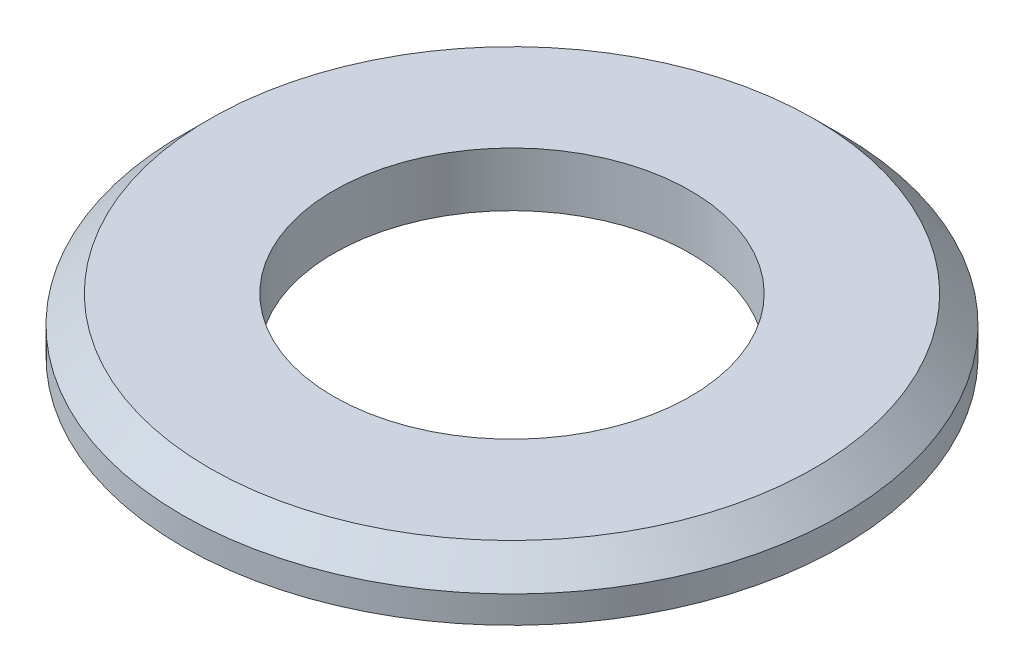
from build123d import *

# Parameters (mm, degrees)
SKETCH1_R      = 42.5
SKETCH1_R_2    = 23
EXTRUDE1_DEPTH = 7
CHAMFER1_SIZE  = 3.5


with BuildPart() as part:
    # Sketch1 → Extrude1 (new body)
    with BuildSketch(Plane(origin=(0, 0, 0), x_dir=(1, 0, 0), z_dir=(0, 1, 0))):
        with Locations(Location((0, 0, 0), (0, 0, 270))):
            Circle(SKETCH1_R)
        with Locations(Location((0, 0, 0), (0, 0, 270))):
            Circle(SKETCH1_R_2, mode=Mode.SUBTRACT)
    extrude(amount=EXTRUDE1_DEPTH)

    # Chamfer1
    chamfer1_edges = [part.edges().sort_by_distance(p)[0] for p in [
        (0, 7, -42.5),
    ]]
    chamfer(chamfer1_edges, length=CHAMFER1_SIZE)


solid = part.part
